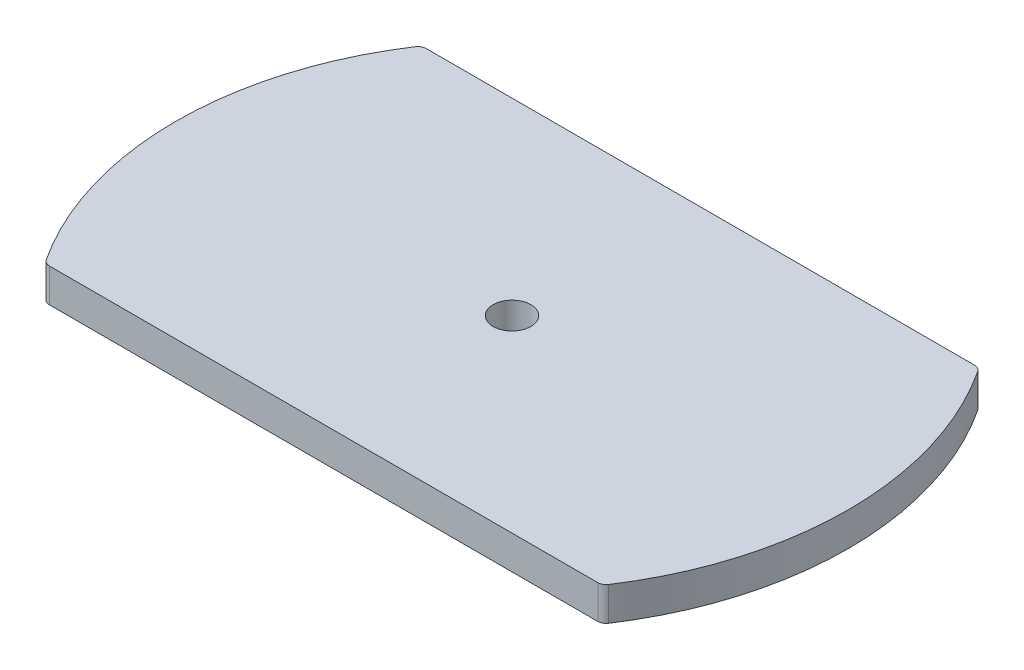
from build123d import *

# Parameters (mm, degrees)
SKETCH1_R           = 3.571875
BOSS_EXTRUDE1_DEPTH = 6.35
SKETCH2_R           = 88.9
SKETCH2_R_2         = 63.5
CUT_EXTRUDE2_DEPTH  = 83.04042723
FILLET1_R           = 1.5875


with BuildPart() as part:
    # Sketch1 → Boss-Extrude1 (new body)
    with BuildSketch(Plane(origin=(0, 0, 0), x_dir=(1, 0, 0), z_dir=(0, 1, 0))):
        with BuildLine():
            Line((-70.485, -35.56), (70.485, -35.56))
            ThreePointArc((70.485, -35.56), (72.73006403, -34.63006403), (73.66, -32.385))
            Line((73.66, -32.385), (73.66, 32.385))
            ThreePointArc((73.66, 32.385), (72.73006403, 34.63006403), (70.485, 35.56))
            Line((70.485, 35.56), (-70.485, 35.56))
            ThreePointArc((-70.485, 35.56), (-72.73006403, 34.63006403), (-73.66, 32.385))
            Line((-73.66, 32.385), (-73.66, -32.385))
            ThreePointArc((-73.66, -32.385), (-72.73006403, -34.63006403), (-70.485, -35.56))
        make_face()
        with Locations(Location((0, 0, 0), (0, 0, 270))):
            Circle(SKETCH1_R, mode=Mode.SUBTRACT)
    extrude(amount=BOSS_EXTRUDE1_DEPTH)

    # Sketch2 → Cut-Extrude2 (cut, through all)
    with BuildSketch(Plane(origin=(0, 0, 0), x_dir=(1, 0, 0), z_dir=(0, 1, 0))):
        Circle(SKETCH2_R)
        Circle(SKETCH2_R_2, mode=Mode.SUBTRACT)
    extrude(amount=CUT_EXTRUDE2_DEPTH, mode=Mode.SUBTRACT)

    # Fillet1
    fillet1_edges = [part.edges().sort_by_distance(p)[0] for p in [
        (52.60928055, 3.175, -35.56),
        (-52.60928055, 3.175, -35.56),
        (52.60928055, 3.175, 35.56),
        (-52.60928055, 3.175, 35.56),
    ]]
    fillet(fillet1_edges, radius=FILLET1_R)


solid = part.part
